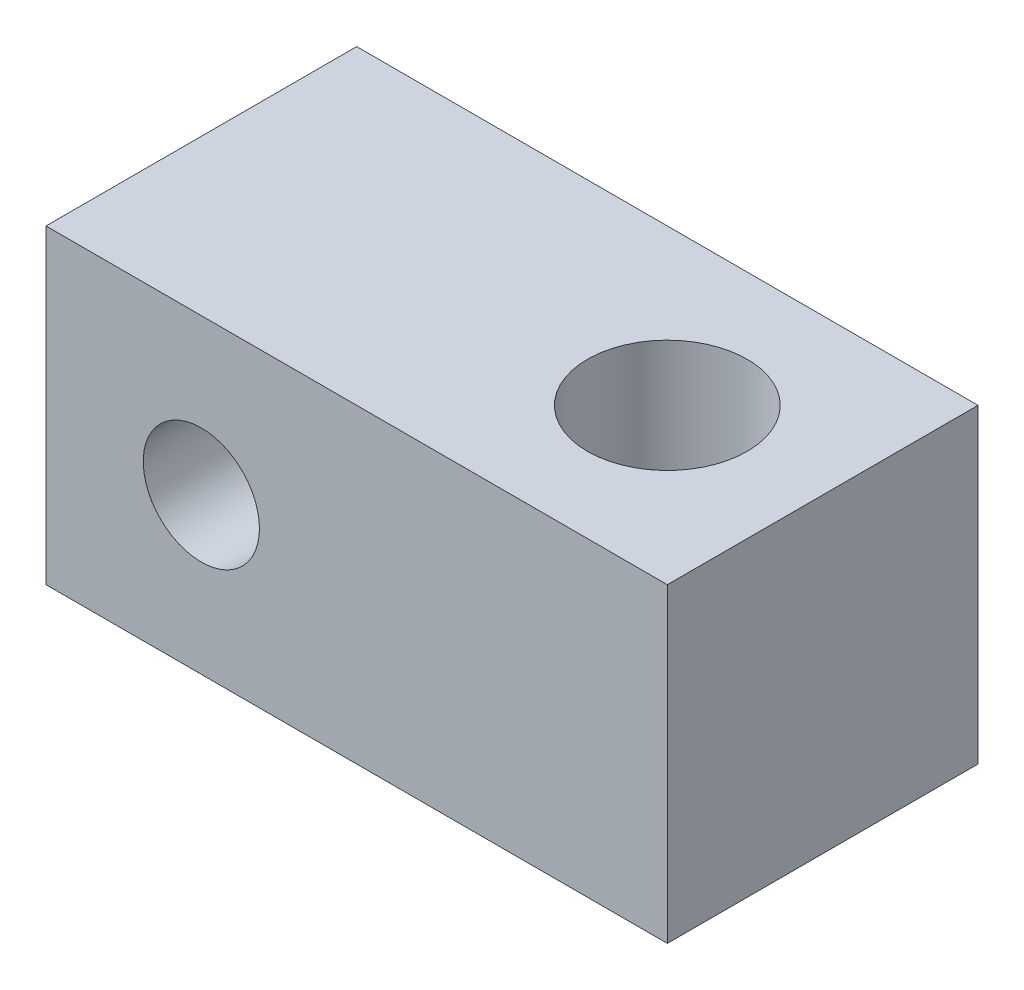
from build123d import *

# Parameters (mm, degrees)
SKETCH1_W                 = 12.7
SKETCH1_H                 = 6.35
EXTRUDE2_DEPTH            = 6.35
TAP_DRILL_FOR_4_48_TAP1_D = 2.3749
F_4_CLEARANCE_HOLE1_D     = 3.2639


with BuildPart() as part:
    # Sketch1 → Extrude2 (new body)
    with BuildSketch(Plane.XY):
        with Locations((6.35, -3.175)):
            Rectangle(SKETCH1_W, SKETCH1_H)
    extrude(amount=EXTRUDE2_DEPTH)

    # Tap Drill for _4-48 Tap1 (through all)
    with Locations(Plane(origin=(3.175, -3.175, 6.35), x_dir=(1, 0, 0), z_dir=(0, 0, 1))):
        with Locations((0, 0)):
            Hole(TAP_DRILL_FOR_4_48_TAP1_D / 2)

    # 4 Clearance Hole1 (through all)
    with Locations(Plane(origin=(9.525, 0, 3.175), x_dir=(0, 0, 1), z_dir=(0, 1, 0))):
        with Locations((0, 0)):
            Hole(F_4_CLEARANCE_HOLE1_D / 2)


solid = part.part
